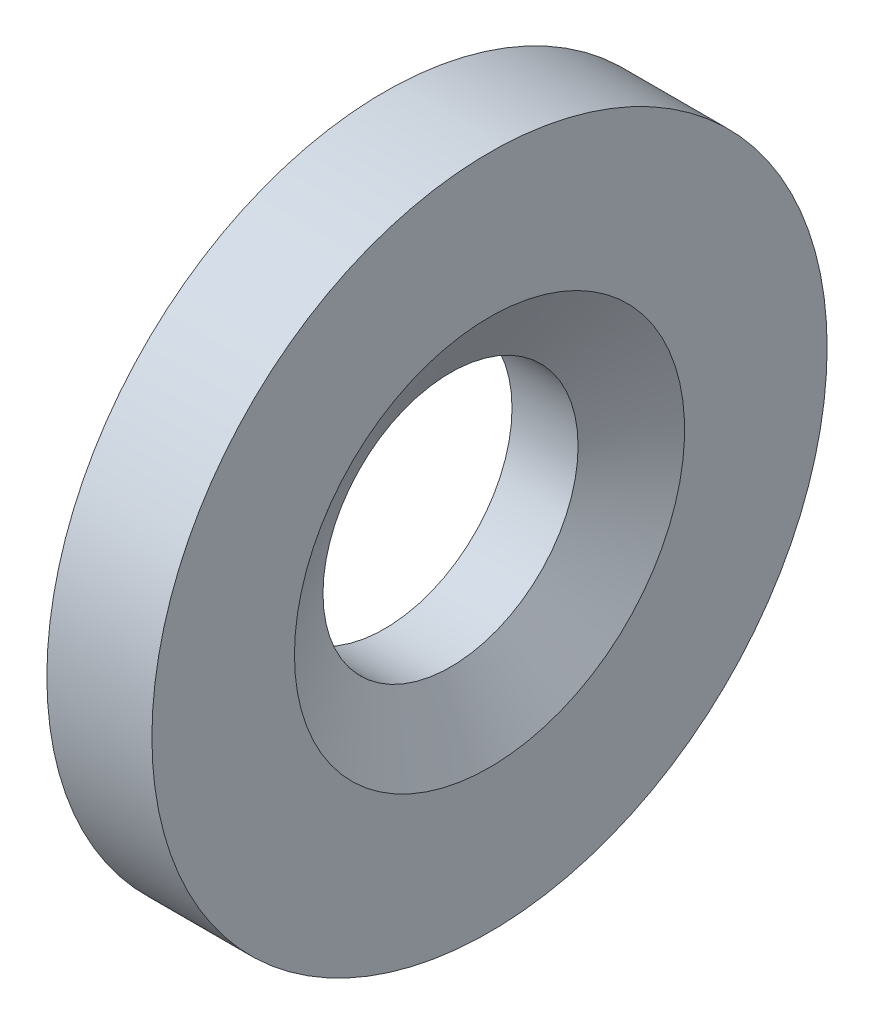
from build123d import *


with BuildPart() as part:
    # Esquisse1 → R_volution1 (revolve)
    with BuildSketch(Plane.XY, mode=Mode.PRIVATE) as r_volution1_sk:
        Polygon((0, 8.5), (0, 22.5), (7, 22.5), (7, 13), (4.401923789, 8.5), align=None)
    revolve(r_volution1_sk.sketch.rotate(Axis((-23.547898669, 0, 0), (1, 0, 0)), 90), axis=Axis((-23.547898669, 0, 0), (1, 0, 0)))


solid = part.part
